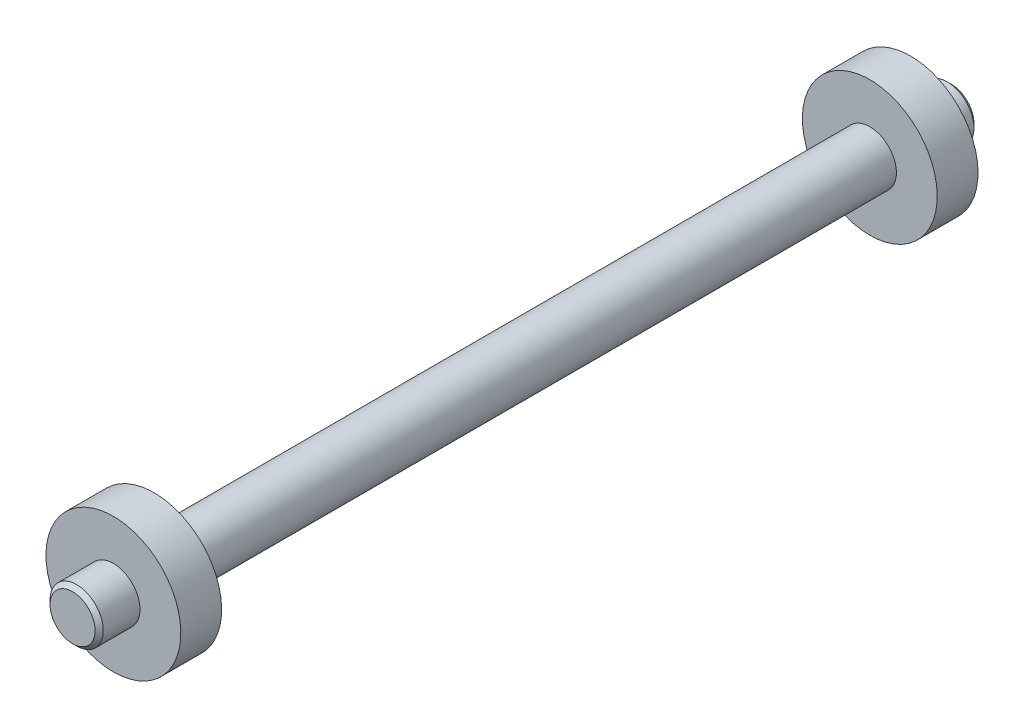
from build123d import *

# Parameters (mm, degrees)
CHAMFER_1_SIZE = 0.1625


with BuildPart() as part:
    # Sketch 2 → Revolve 1 (revolve)
    with BuildSketch(Plane(origin=(0, 0, 0), x_dir=(0, 0, -1), z_dir=(1, 0, 0)), mode=Mode.PRIVATE) as revolve_1_sk:
        Polygon((-17.5, 0), (17.5, 0), (17.5, 1.06), (15.875, 1.06), (15.875, 2.685), (14.25, 2.685), (14.25, 1.06), (-14.25, 1.06), (-14.25, 2.685), (-15.875, 2.685), (-15.875, 1.06), (-17.5, 1.06), align=None)
    revolve(revolve_1_sk.sketch.rotate(Axis((0, 0, 17.5), (0, 0, -1)), 180), axis=Axis((0, 0, 17.5), (0, 0, -1)))

    # Chamfer 1
    chamfer_1_edges = [part.edges().sort_by_distance(p)[0] for p in [
        (0, 1.06, 17.5),
        (0, 1.06, -17.5),
    ]]
    chamfer(chamfer_1_edges, length=CHAMFER_1_SIZE)


solid = part.part
